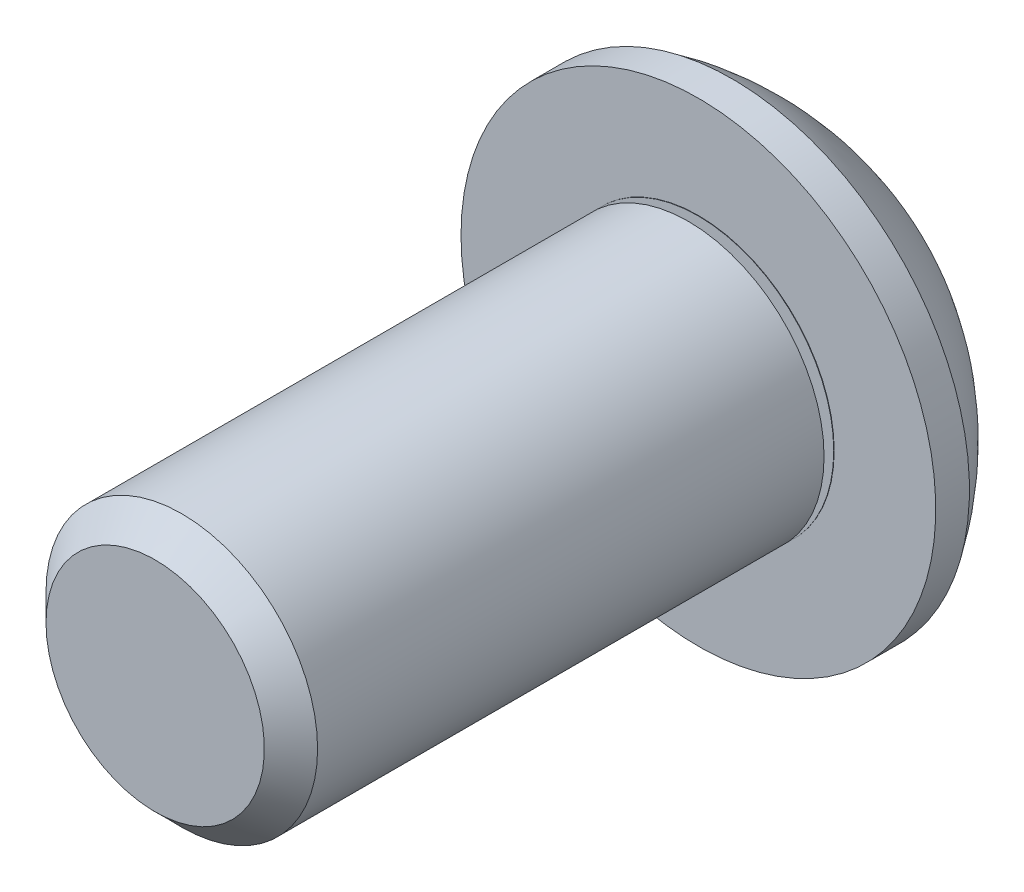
from build123d import *

# Parameters (mm, degrees)
CUT_EXTRUDE1_DEPTH = 2.2098


with BuildPart() as part:
    # Logo3_bib1 → Revolve1 (revolve)
    with BuildSketch(Plane(origin=(0, 0, 0), x_dir=(-1, 0, 0), z_dir=(0, -1, 0))):
        with BuildLine():
            Line((0, -12.7), (0, 3.3528))
            Line((0, 3.3528), (2.4765, 3.3528))
            ThreePointArc((2.4765, 3.3528), (4.20456149, 2.299354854), (5.5499, 0.7874))
            Line((5.5499, 0.7874), (5.5499, 0))
            Line((5.5499, 0), (3.175, 0))
            Line((3.175, 0), (3.175, -0.01))
            Line((3.175, -0.01), (2.666125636, -0.01))
            ThreePointArc((2.666125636, -0.01), (2.646429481, -0.026527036), (2.659285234, -0.048793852))
            Line((2.659285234, -0.048793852), (3.175, -0.236498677))
            Line((3.175, -0.236498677), (3.175, -12.0777))
            Line((3.175, -12.0777), (2.5527, -12.7))
            Line((2.5527, -12.7), (0, -12.7))
        make_face()
    revolve(axis=Axis((0, 0, -10.585154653), (0, 0, 1)))

    # Logo3_bib2 → Cut-Extrude1 (cut)
    with BuildSketch(Plane(origin=(0, 0, -3.3528), x_dir=(1, 0, 0), z_dir=(0, 0, -1))):
        Polygon((2.287692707, 0), (1.143846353, 1.9812), (-1.143846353, 1.9812), (-2.287692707, 0), (-1.143846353, -1.9812), (1.143846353, -1.9812), align=None)
    extrude(amount=-CUT_EXTRUDE1_DEPTH, mode=Mode.SUBTRACT)


solid = part.part
